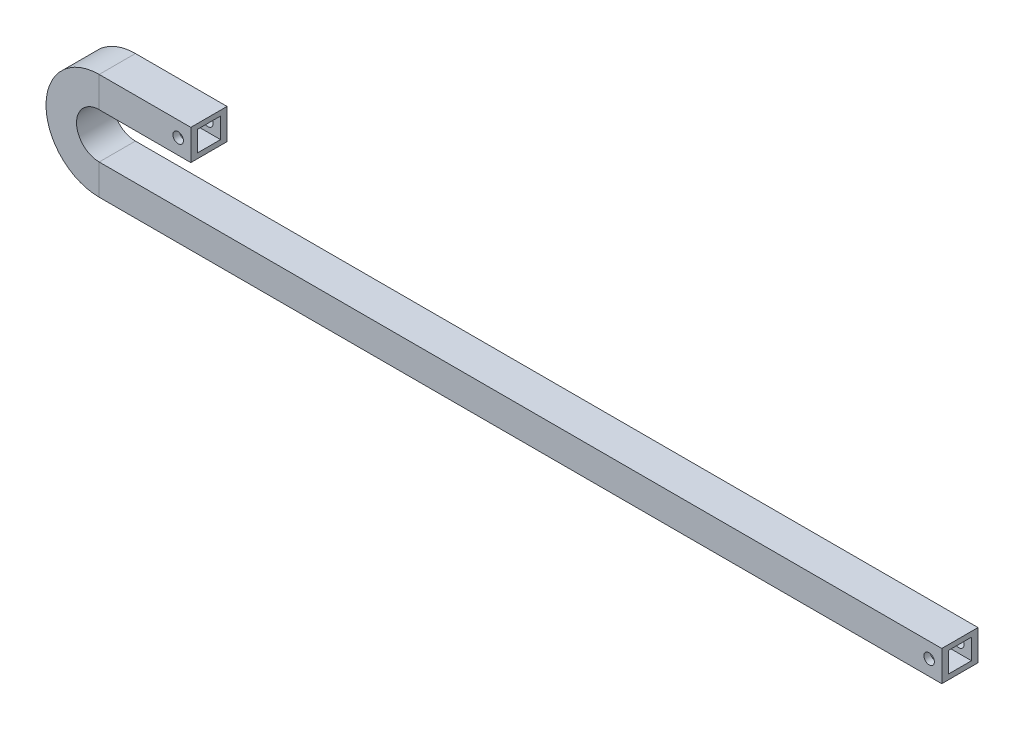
ISO-10303-21;
HEADER;
FILE_DESCRIPTION(('STEP AP214'),'2;1');
FILE_NAME('part.step','',(''),(''),'','','');
FILE_SCHEMA(('AUTOMOTIVE_DESIGN { 1 0 10303 214 1 1 1 1 }'));
ENDSEC;
DATA;
#1=APPLICATION_CONTEXT('core data for automotive mechanical design processes');
#2=APPLICATION_PROTOCOL_DEFINITION('international standard','automotive_design',2000,#1);
#3=PRODUCT_CONTEXT('',#1,'mechanical');
#4=PRODUCT('Part','Part','',(#3));
#5=PRODUCT_RELATED_PRODUCT_CATEGORY('part','',(#4));
#6=PRODUCT_DEFINITION_FORMATION('','',#4);
#7=PRODUCT_DEFINITION_CONTEXT('part definition',#1,'design');
#8=PRODUCT_DEFINITION('design','',#6,#7);
#9=PRODUCT_DEFINITION_SHAPE('','',#8);
#10=(LENGTH_UNIT() NAMED_UNIT(*) SI_UNIT(.MILLI.,.METRE.));
#11=(NAMED_UNIT(*) PLANE_ANGLE_UNIT() SI_UNIT($,.RADIAN.));
#12=(NAMED_UNIT(*) SI_UNIT($,.STERADIAN.) SOLID_ANGLE_UNIT());
#13=UNCERTAINTY_MEASURE_WITH_UNIT(LENGTH_MEASURE(1.E-05),#10,'distance_accuracy_value','');
#14=(GEOMETRIC_REPRESENTATION_CONTEXT(3) GLOBAL_UNCERTAINTY_ASSIGNED_CONTEXT((#13)) GLOBAL_UNIT_ASSIGNED_CONTEXT((#10,
#11,#12)) REPRESENTATION_CONTEXT('',''));
#15=CARTESIAN_POINT('',(0.,0.,0.));
#16=DIRECTION('',(0.,0.,1.));
#17=DIRECTION('',(1.,0.,0.));
#18=AXIS2_PLACEMENT_3D('',#15,#16,#17);
#19=CARTESIAN_POINT('',(-400.,31.15,5.5));
#20=DIRECTION('',(0.,1.,0.));
#21=DIRECTION('',(-1.,0.,0.));
#22=AXIS2_PLACEMENT_3D('',#19,#20,#21);
#23=PLANE('',#22);
#24=DIRECTION('',(0.,0.,1.));
#25=VECTOR('',#24,1.);
#26=CARTESIAN_POINT('',(-400.,31.15,5.5));
#27=LINE('',#26,#25);
#28=CARTESIAN_POINT('',(-400.,31.15,-5.5));
#29=VERTEX_POINT('',#28);
#30=CARTESIAN_POINT('',(-400.,31.15,5.5));
#31=VERTEX_POINT('',#30);
#32=EDGE_CURVE('E326',#29,#31,#27,.T.);
#33=ORIENTED_EDGE('',*,*,#32,.T.);
#34=DIRECTION('',(1.,0.,0.));
#35=VECTOR('',#34,1.);
#36=CARTESIAN_POINT('',(-400.,31.15,5.5));
#37=LINE('',#36,#35);
#38=CARTESIAN_POINT('',(-356.5,31.1499999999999,5.5));
#39=VERTEX_POINT('',#38);
#40=EDGE_CURVE('E55',#31,#39,#37,.T.);
#41=ORIENTED_EDGE('',*,*,#40,.T.);
#42=DIRECTION('',(0.,0.,1.));
#43=VECTOR('',#42,1.);
#44=CARTESIAN_POINT('',(-356.5,31.1499999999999,5.5));
#45=LINE('',#44,#43);
#46=CARTESIAN_POINT('',(-356.5,31.1499999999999,-5.5));
#47=VERTEX_POINT('',#46);
#48=EDGE_CURVE('E65',#47,#39,#45,.T.);
#49=ORIENTED_EDGE('',*,*,#48,.F.);
#50=DIRECTION('',(1.,0.,0.));
#51=VECTOR('',#50,1.);
#52=CARTESIAN_POINT('',(-400.,31.15,-5.5));
#53=LINE('',#52,#51);
#54=EDGE_CURVE('E11',#29,#47,#53,.T.);
#55=ORIENTED_EDGE('',*,*,#54,.F.);
#56=EDGE_LOOP('',(#33,#41,#49,#55));
#57=FACE_BOUND('',#56,.T.);
#58=ADVANCED_FACE('F47',(#57),#23,.T.);
#59=CARTESIAN_POINT('',(-400.,40.85,5.5));
#60=DIRECTION('',(0.,0.,-1.));
#61=DIRECTION('',(-1.,0.,0.));
#62=AXIS2_PLACEMENT_3D('',#59,#60,#61);
#63=PLANE('',#62);
#64=CARTESIAN_POINT('',(-362.5,36.,5.5));
#65=DIRECTION('',(0.,0.,-1.));
#66=DIRECTION('',(-1.,0.,0.));
#67=AXIS2_PLACEMENT_3D('',#64,#65,#66);
#68=CIRCLE('',#67,2.49999999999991);
#69=CARTESIAN_POINT('',(-360.,36.,5.5));
#70=VERTEX_POINT('',#69);
#71=EDGE_CURVE('E232',#70,#70,#68,.T.);
#72=ORIENTED_EDGE('',*,*,#71,.F.);
#73=EDGE_LOOP('',(#72));
#74=FACE_BOUND('',#73,.T.);
#75=DIRECTION('',(0.,1.,0.));
#76=VECTOR('',#75,1.);
#77=CARTESIAN_POINT('',(-400.,40.85,5.5));
#78=LINE('',#77,#76);
#79=CARTESIAN_POINT('',(-400.,40.85,5.5));
#80=VERTEX_POINT('',#79);
#81=EDGE_CURVE('E322',#31,#80,#78,.T.);
#82=ORIENTED_EDGE('',*,*,#81,.T.);
#83=DIRECTION('',(1.,0.,0.));
#84=VECTOR('',#83,1.);
#85=CARTESIAN_POINT('',(-400.,40.85,5.5));
#86=LINE('',#85,#84);
#87=CARTESIAN_POINT('',(-356.5,40.85,5.5));
#88=VERTEX_POINT('',#87);
#89=EDGE_CURVE('E397',#80,#88,#86,.T.);
#90=ORIENTED_EDGE('',*,*,#89,.T.);
#91=DIRECTION('',(0.,1.,0.));
#92=VECTOR('',#91,1.);
#93=CARTESIAN_POINT('',(-356.5,40.85,5.5));
#94=LINE('',#93,#92);
#95=EDGE_CURVE('E74',#39,#88,#94,.T.);
#96=ORIENTED_EDGE('',*,*,#95,.F.);
#97=ORIENTED_EDGE('',*,*,#40,.F.);
#98=EDGE_LOOP('',(#82,#90,#96,#97));
#99=FACE_BOUND('',#98,.T.);
#100=ADVANCED_FACE('F404',(#74,#99),#63,.T.);
#101=CARTESIAN_POINT('',(-400.,40.85,5.5));
#102=DIRECTION('',(0.,-1.,0.));
#103=DIRECTION('',(1.,0.,0.));
#104=AXIS2_PLACEMENT_3D('',#101,#102,#103);
#105=PLANE('',#104);
#106=DIRECTION('',(0.,0.,-1.));
#107=VECTOR('',#106,1.);
#108=CARTESIAN_POINT('',(-400.,40.85,5.5));
#109=LINE('',#108,#107);
#110=CARTESIAN_POINT('',(-400.,40.85,-5.5));
#111=VERTEX_POINT('',#110);
#112=EDGE_CURVE('E317',#80,#111,#109,.T.);
#113=ORIENTED_EDGE('',*,*,#112,.T.);
#114=DIRECTION('',(1.,0.,0.));
#115=VECTOR('',#114,1.);
#116=CARTESIAN_POINT('',(-400.,40.85,-5.5));
#117=LINE('',#116,#115);
#118=CARTESIAN_POINT('',(-356.5,40.85,-5.5));
#119=VERTEX_POINT('',#118);
#120=EDGE_CURVE('E379',#111,#119,#117,.T.);
#121=ORIENTED_EDGE('',*,*,#120,.T.);
#122=DIRECTION('',(0.,0.,-1.));
#123=VECTOR('',#122,1.);
#124=CARTESIAN_POINT('',(-356.5,40.85,5.5));
#125=LINE('',#124,#123);
#126=EDGE_CURVE('E370',#88,#119,#125,.T.);
#127=ORIENTED_EDGE('',*,*,#126,.F.);
#128=ORIENTED_EDGE('',*,*,#89,.F.);
#129=EDGE_LOOP('',(#113,#121,#127,#128));
#130=FACE_BOUND('',#129,.T.);
#131=ADVANCED_FACE('F450',(#130),#105,.T.);
#132=CARTESIAN_POINT('',(-400.,40.85,-5.5));
#133=DIRECTION('',(0.,0.,1.));
#134=DIRECTION('',(1.,0.,0.));
#135=AXIS2_PLACEMENT_3D('',#132,#133,#134);
#136=PLANE('',#135);
#137=CARTESIAN_POINT('',(-362.5,36.,-5.5));
#138=DIRECTION('',(0.,0.,1.));
#139=DIRECTION('',(1.,0.,0.));
#140=AXIS2_PLACEMENT_3D('',#137,#138,#139);
#141=CIRCLE('',#140,2.49999999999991);
#142=CARTESIAN_POINT('',(-360.,36.,-5.5));
#143=VERTEX_POINT('',#142);
#144=EDGE_CURVE('E828',#143,#143,#141,.T.);
#145=ORIENTED_EDGE('',*,*,#144,.F.);
#146=EDGE_LOOP('',(#145));
#147=FACE_BOUND('',#146,.T.);
#148=DIRECTION('',(0.,-1.,0.));
#149=VECTOR('',#148,1.);
#150=CARTESIAN_POINT('',(-400.,40.85,-5.5));
#151=LINE('',#150,#149);
#152=EDGE_CURVE('E313',#111,#29,#151,.T.);
#153=ORIENTED_EDGE('',*,*,#152,.T.);
#154=ORIENTED_EDGE('',*,*,#54,.T.);
#155=DIRECTION('',(0.,-1.,0.));
#156=VECTOR('',#155,1.);
#157=CARTESIAN_POINT('',(-356.5,40.85,-5.5));
#158=LINE('',#157,#156);
#159=EDGE_CURVE('E367',#119,#47,#158,.T.);
#160=ORIENTED_EDGE('',*,*,#159,.F.);
#161=ORIENTED_EDGE('',*,*,#120,.F.);
#162=EDGE_LOOP('',(#153,#154,#160,#161));
#163=FACE_BOUND('',#162,.T.);
#164=ADVANCED_FACE('F455',(#147,#163),#136,.T.);
#165=CARTESIAN_POINT('',(-400.,43.25,8.6));
#166=DIRECTION('',(0.,-1.,0.));
#167=DIRECTION('',(1.,0.,0.));
#168=AXIS2_PLACEMENT_3D('',#165,#166,#167);
#169=PLANE('',#168);
#170=DIRECTION('',(0.,0.,-1.));
#171=VECTOR('',#170,1.);
#172=CARTESIAN_POINT('',(-400.,43.25,8.6));
#173=LINE('',#172,#171);
#174=CARTESIAN_POINT('',(-400.,43.25,8.6));
#175=VERTEX_POINT('',#174);
#176=CARTESIAN_POINT('',(-400.,43.25,-8.6));
#177=VERTEX_POINT('',#176);
#178=EDGE_CURVE('E197',#175,#177,#173,.T.);
#179=ORIENTED_EDGE('',*,*,#178,.F.);
#180=DIRECTION('',(1.,0.,0.));
#181=VECTOR('',#180,1.);
#182=CARTESIAN_POINT('',(-400.,43.25,8.6));
#183=LINE('',#182,#181);
#184=CARTESIAN_POINT('',(-356.5,43.25,8.6));
#185=VERTEX_POINT('',#184);
#186=EDGE_CURVE('E387',#175,#185,#183,.T.);
#187=ORIENTED_EDGE('',*,*,#186,.T.);
#188=DIRECTION('',(0.,0.,-1.));
#189=VECTOR('',#188,1.);
#190=CARTESIAN_POINT('',(-356.5,43.25,8.6));
#191=LINE('',#190,#189);
#192=CARTESIAN_POINT('',(-356.5,43.25,-8.6));
#193=VERTEX_POINT('',#192);
#194=EDGE_CURVE('E363',#185,#193,#191,.T.);
#195=ORIENTED_EDGE('',*,*,#194,.T.);
#196=DIRECTION('',(1.,0.,0.));
#197=VECTOR('',#196,1.);
#198=CARTESIAN_POINT('',(-400.,43.25,-8.6));
#199=LINE('',#198,#197);
#200=EDGE_CURVE('E371',#177,#193,#199,.T.);
#201=ORIENTED_EDGE('',*,*,#200,.F.);
#202=EDGE_LOOP('',(#179,#187,#195,#201));
#203=FACE_BOUND('',#202,.T.);
#204=ADVANCED_FACE('F461',(#203),#169,.F.);
#205=CARTESIAN_POINT('',(-400.,43.25,8.6));
#206=DIRECTION('',(0.,0.,-1.));
#207=DIRECTION('',(-1.,0.,0.));
#208=AXIS2_PLACEMENT_3D('',#205,#206,#207);
#209=PLANE('',#208);
#210=CARTESIAN_POINT('',(-362.5,36.,8.6));
#211=DIRECTION('',(0.,0.,1.));
#212=DIRECTION('',(1.,0.,0.));
#213=AXIS2_PLACEMENT_3D('',#210,#211,#212);
#214=CIRCLE('',#213,2.49999999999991);
#215=CARTESIAN_POINT('',(-360.,36.,8.59999999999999));
#216=VERTEX_POINT('',#215);
#217=EDGE_CURVE('E812',#216,#216,#214,.T.);
#218=ORIENTED_EDGE('',*,*,#217,.F.);
#219=EDGE_LOOP('',(#218));
#220=FACE_BOUND('',#219,.T.);
#221=DIRECTION('',(0.,1.,0.));
#222=VECTOR('',#221,1.);
#223=CARTESIAN_POINT('',(-400.,43.25,8.6));
#224=LINE('',#223,#222);
#225=CARTESIAN_POINT('',(-400.,28.75,8.6));
#226=VERTEX_POINT('',#225);
#227=EDGE_CURVE('E306',#226,#175,#224,.T.);
#228=ORIENTED_EDGE('',*,*,#227,.F.);
#229=DIRECTION('',(1.,0.,0.));
#230=VECTOR('',#229,1.);
#231=CARTESIAN_POINT('',(-400.,28.75,8.6));
#232=LINE('',#231,#230);
#233=CARTESIAN_POINT('',(-356.5,28.75,8.6));
#234=VERTEX_POINT('',#233);
#235=EDGE_CURVE('E383',#226,#234,#232,.T.);
#236=ORIENTED_EDGE('',*,*,#235,.T.);
#237=DIRECTION('',(0.,1.,0.));
#238=VECTOR('',#237,1.);
#239=CARTESIAN_POINT('',(-356.5,43.25,8.6));
#240=LINE('',#239,#238);
#241=EDGE_CURVE('E360',#234,#185,#240,.T.);
#242=ORIENTED_EDGE('',*,*,#241,.T.);
#243=ORIENTED_EDGE('',*,*,#186,.F.);
#244=EDGE_LOOP('',(#228,#236,#242,#243));
#245=FACE_BOUND('',#244,.T.);
#246=ADVANCED_FACE('F465',(#220,#245),#209,.F.);
#247=CARTESIAN_POINT('',(-400.,28.75,8.6));
#248=DIRECTION('',(0.,1.,0.));
#249=DIRECTION('',(-1.,0.,0.));
#250=AXIS2_PLACEMENT_3D('',#247,#248,#249);
#251=PLANE('',#250);
#252=DIRECTION('',(0.,0.,1.));
#253=VECTOR('',#252,1.);
#254=CARTESIAN_POINT('',(-400.,28.75,8.6));
#255=LINE('',#254,#253);
#256=CARTESIAN_POINT('',(-400.,28.75,-8.6));
#257=VERTEX_POINT('',#256);
#258=EDGE_CURVE('E303',#257,#226,#255,.T.);
#259=ORIENTED_EDGE('',*,*,#258,.F.);
#260=DIRECTION('',(1.,0.,0.));
#261=VECTOR('',#260,1.);
#262=CARTESIAN_POINT('',(-400.,28.75,-8.6));
#263=LINE('',#262,#261);
#264=CARTESIAN_POINT('',(-356.5,28.75,-8.6));
#265=VERTEX_POINT('',#264);
#266=EDGE_CURVE('E366',#257,#265,#263,.T.);
#267=ORIENTED_EDGE('',*,*,#266,.T.);
#268=DIRECTION('',(0.,0.,1.));
#269=VECTOR('',#268,1.);
#270=CARTESIAN_POINT('',(-356.5,28.75,8.6));
#271=LINE('',#270,#269);
#272=EDGE_CURVE('E357',#265,#234,#271,.T.);
#273=ORIENTED_EDGE('',*,*,#272,.T.);
#274=ORIENTED_EDGE('',*,*,#235,.F.);
#275=EDGE_LOOP('',(#259,#267,#273,#274));
#276=FACE_BOUND('',#275,.T.);
#277=ADVANCED_FACE('F443',(#276),#251,.F.);
#278=CARTESIAN_POINT('',(-400.,43.25,-8.6));
#279=DIRECTION('',(0.,0.,1.));
#280=DIRECTION('',(1.,0.,0.));
#281=AXIS2_PLACEMENT_3D('',#278,#279,#280);
#282=PLANE('',#281);
#283=CARTESIAN_POINT('',(-362.5,36.,-8.6));
#284=DIRECTION('',(0.,0.,1.));
#285=DIRECTION('',(1.,0.,0.));
#286=AXIS2_PLACEMENT_3D('',#283,#284,#285);
#287=CIRCLE('',#286,2.49999999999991);
#288=CARTESIAN_POINT('',(-360.,36.,-8.6));
#289=VERTEX_POINT('',#288);
#290=EDGE_CURVE('E820',#289,#289,#287,.T.);
#291=ORIENTED_EDGE('',*,*,#290,.T.);
#292=EDGE_LOOP('',(#291));
#293=FACE_BOUND('',#292,.T.);
#294=DIRECTION('',(0.,-1.,0.));
#295=VECTOR('',#294,1.);
#296=CARTESIAN_POINT('',(-400.,43.25,-8.6));
#297=LINE('',#296,#295);
#298=EDGE_CURVE('E192',#177,#257,#297,.T.);
#299=ORIENTED_EDGE('',*,*,#298,.F.);
#300=ORIENTED_EDGE('',*,*,#200,.T.);
#301=DIRECTION('',(0.,-1.,0.));
#302=VECTOR('',#301,1.);
#303=CARTESIAN_POINT('',(-356.5,43.25,-8.6));
#304=LINE('',#303,#302);
#305=EDGE_CURVE('E354',#193,#265,#304,.T.);
#306=ORIENTED_EDGE('',*,*,#305,.T.);
#307=ORIENTED_EDGE('',*,*,#266,.F.);
#308=EDGE_LOOP('',(#299,#300,#306,#307));
#309=FACE_BOUND('',#308,.T.);
#310=ADVANCED_FACE('F436',(#293,#309),#282,.F.);
#311=CARTESIAN_POINT('',(-400.,18.,0.));
#312=DIRECTION('',(0.,0.,-1.));
#313=DIRECTION('',(-1.,0.,0.));
#314=AXIS2_PLACEMENT_3D('',#311,#312,#313);
#315=CYLINDRICAL_SURFACE('',#314,13.15);
#316=DIRECTION('',(0.,0.,1.));
#317=VECTOR('',#316,1.);
#318=CARTESIAN_POINT('',(-400.,4.84999999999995,5.5));
#319=LINE('',#318,#317);
#320=CARTESIAN_POINT('',(-400.,4.84999999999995,-5.5));
#321=VERTEX_POINT('',#320);
#322=CARTESIAN_POINT('',(-400.,4.84999999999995,5.5));
#323=VERTEX_POINT('',#322);
#324=EDGE_CURVE('E219',#321,#323,#319,.T.);
#325=ORIENTED_EDGE('',*,*,#324,.T.);
#326=CARTESIAN_POINT('',(-400.,18.,5.5));
#327=DIRECTION('',(0.,0.,-1.));
#328=DIRECTION('',(-1.,0.,0.));
#329=AXIS2_PLACEMENT_3D('',#326,#327,#328);
#330=CIRCLE('',#329,13.15);
#331=EDGE_CURVE('E346',#323,#31,#330,.T.);
#332=ORIENTED_EDGE('',*,*,#331,.T.);
#333=ORIENTED_EDGE('',*,*,#32,.F.);
#334=CARTESIAN_POINT('',(-400.,18.,-5.5));
#335=DIRECTION('',(0.,0.,-1.));
#336=DIRECTION('',(-1.,0.,0.));
#337=AXIS2_PLACEMENT_3D('',#334,#335,#336);
#338=CIRCLE('',#337,13.15);
#339=EDGE_CURVE('E350',#321,#29,#338,.T.);
#340=ORIENTED_EDGE('',*,*,#339,.F.);
#341=EDGE_LOOP('',(#325,#332,#333,#340));
#342=FACE_BOUND('',#341,.T.);
#343=ADVANCED_FACE('F434',(#342),#315,.T.);
#344=CARTESIAN_POINT('',(-400.,-4.85000000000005,5.5));
#345=DIRECTION('',(0.,0.,-1.));
#346=DIRECTION('',(-1.,0.,0.));
#347=AXIS2_PLACEMENT_3D('',#344,#345,#346);
#348=PLANE('',#347);
#349=DIRECTION('',(0.,-1.,0.));
#350=VECTOR('',#349,1.);
#351=CARTESIAN_POINT('',(-400.,-4.85000000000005,5.5));
#352=LINE('',#351,#350);
#353=CARTESIAN_POINT('',(-400.,-4.85000000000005,5.5));
#354=VERTEX_POINT('',#353);
#355=EDGE_CURVE('E249',#323,#354,#352,.T.);
#356=ORIENTED_EDGE('',*,*,#355,.T.);
#357=CARTESIAN_POINT('',(-400.,18.,5.5));
#358=DIRECTION('',(0.,0.,-1.));
#359=DIRECTION('',(-1.,0.,0.));
#360=AXIS2_PLACEMENT_3D('',#357,#358,#359);
#361=CIRCLE('',#360,22.85);
#362=EDGE_CURVE('E342',#354,#80,#361,.T.);
#363=ORIENTED_EDGE('',*,*,#362,.T.);
#364=ORIENTED_EDGE('',*,*,#81,.F.);
#365=ORIENTED_EDGE('',*,*,#331,.F.);
#366=EDGE_LOOP('',(#356,#363,#364,#365));
#367=FACE_BOUND('',#366,.T.);
#368=ADVANCED_FACE('F411',(#367),#348,.T.);
#369=CARTESIAN_POINT('',(-400.,18.,0.));
#370=DIRECTION('',(0.,0.,-1.));
#371=DIRECTION('',(-1.,0.,0.));
#372=AXIS2_PLACEMENT_3D('',#369,#370,#371);
#373=CYLINDRICAL_SURFACE('',#372,22.85);
#374=DIRECTION('',(0.,0.,-1.));
#375=VECTOR('',#374,1.);
#376=CARTESIAN_POINT('',(-400.,-4.85000000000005,5.5));
#377=LINE('',#376,#375);
#378=CARTESIAN_POINT('',(-400.,-4.85000000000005,-5.5));
#379=VERTEX_POINT('',#378);
#380=EDGE_CURVE('E245',#354,#379,#377,.T.);
#381=ORIENTED_EDGE('',*,*,#380,.T.);
#382=CARTESIAN_POINT('',(-400.,18.,-5.5));
#383=DIRECTION('',(0.,0.,-1.));
#384=DIRECTION('',(-1.,0.,0.));
#385=AXIS2_PLACEMENT_3D('',#382,#383,#384);
#386=CIRCLE('',#385,22.85);
#387=EDGE_CURVE('E329',#379,#111,#386,.T.);
#388=ORIENTED_EDGE('',*,*,#387,.T.);
#389=ORIENTED_EDGE('',*,*,#112,.F.);
#390=ORIENTED_EDGE('',*,*,#362,.F.);
#391=EDGE_LOOP('',(#381,#388,#389,#390));
#392=FACE_BOUND('',#391,.T.);
#393=ADVANCED_FACE('F408',(#392),#373,.F.);
#394=CARTESIAN_POINT('',(-400.,-4.85000000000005,-5.5));
#395=DIRECTION('',(0.,0.,1.));
#396=DIRECTION('',(1.,0.,0.));
#397=AXIS2_PLACEMENT_3D('',#394,#395,#396);
#398=PLANE('',#397);
#399=DIRECTION('',(0.,1.,0.));
#400=VECTOR('',#399,1.);
#401=CARTESIAN_POINT('',(-400.,-4.85000000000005,-5.5));
#402=LINE('',#401,#400);
#403=EDGE_CURVE('E241',#379,#321,#402,.T.);
#404=ORIENTED_EDGE('',*,*,#403,.T.);
#405=ORIENTED_EDGE('',*,*,#339,.T.);
#406=ORIENTED_EDGE('',*,*,#152,.F.);
#407=ORIENTED_EDGE('',*,*,#387,.F.);
#408=EDGE_LOOP('',(#404,#405,#406,#407));
#409=FACE_BOUND('',#408,.T.);
#410=ADVANCED_FACE('F429',(#409),#398,.T.);
#411=CARTESIAN_POINT('',(-400.,18.,0.));
#412=DIRECTION('',(0.,0.,-1.));
#413=DIRECTION('',(-1.,0.,0.));
#414=AXIS2_PLACEMENT_3D('',#411,#412,#413);
#415=CYLINDRICAL_SURFACE('',#414,25.25);
#416=DIRECTION('',(0.,0.,-1.));
#417=VECTOR('',#416,1.);
#418=CARTESIAN_POINT('',(-400.,-7.25000000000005,8.6));
#419=LINE('',#418,#417);
#420=CARTESIAN_POINT('',(-400.,-7.25000000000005,8.6));
#421=VERTEX_POINT('',#420);
#422=CARTESIAN_POINT('',(-400.,-7.25000000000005,-8.6));
#423=VERTEX_POINT('',#422);
#424=EDGE_CURVE('E238',#421,#423,#419,.T.);
#425=ORIENTED_EDGE('',*,*,#424,.F.);
#426=CARTESIAN_POINT('',(-400.,18.,8.6));
#427=DIRECTION('',(0.,0.,-1.));
#428=DIRECTION('',(-1.,0.,0.));
#429=AXIS2_PLACEMENT_3D('',#426,#427,#428);
#430=CIRCLE('',#429,25.25);
#431=EDGE_CURVE('E333',#421,#175,#430,.T.);
#432=ORIENTED_EDGE('',*,*,#431,.T.);
#433=ORIENTED_EDGE('',*,*,#178,.T.);
#434=CARTESIAN_POINT('',(-400.,18.,-8.6));
#435=DIRECTION('',(0.,0.,-1.));
#436=DIRECTION('',(-1.,0.,0.));
#437=AXIS2_PLACEMENT_3D('',#434,#435,#436);
#438=CIRCLE('',#437,25.25);
#439=EDGE_CURVE('E318',#423,#177,#438,.T.);
#440=ORIENTED_EDGE('',*,*,#439,.F.);
#441=EDGE_LOOP('',(#425,#432,#433,#440));
#442=FACE_BOUND('',#441,.T.);
#443=ADVANCED_FACE('F491',(#442),#415,.T.);
#444=CARTESIAN_POINT('',(-400.,-7.25000000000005,8.6));
#445=DIRECTION('',(0.,0.,-1.));
#446=DIRECTION('',(-1.,0.,0.));
#447=AXIS2_PLACEMENT_3D('',#444,#445,#446);
#448=PLANE('',#447);
#449=DIRECTION('',(0.,-1.,0.));
#450=VECTOR('',#449,1.);
#451=CARTESIAN_POINT('',(-400.,-7.25000000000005,8.6));
#452=LINE('',#451,#450);
#453=CARTESIAN_POINT('',(-400.,7.24999999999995,8.6));
#454=VERTEX_POINT('',#453);
#455=EDGE_CURVE('E207',#454,#421,#452,.T.);
#456=ORIENTED_EDGE('',*,*,#455,.F.);
#457=CARTESIAN_POINT('',(-400.,18.,8.6));
#458=DIRECTION('',(0.,0.,-1.));
#459=DIRECTION('',(-1.,0.,0.));
#460=AXIS2_PLACEMENT_3D('',#457,#458,#459);
#461=CIRCLE('',#460,10.75);
#462=EDGE_CURVE('E196',#454,#226,#461,.T.);
#463=ORIENTED_EDGE('',*,*,#462,.T.);
#464=ORIENTED_EDGE('',*,*,#227,.T.);
#465=ORIENTED_EDGE('',*,*,#431,.F.);
#466=EDGE_LOOP('',(#456,#463,#464,#465));
#467=FACE_BOUND('',#466,.T.);
#468=ADVANCED_FACE('F477',(#467),#448,.F.);
#469=CARTESIAN_POINT('',(-400.,18.,0.));
#470=DIRECTION('',(0.,0.,-1.));
#471=DIRECTION('',(-1.,0.,0.));
#472=AXIS2_PLACEMENT_3D('',#469,#470,#471);
#473=CYLINDRICAL_SURFACE('',#472,10.75);
#474=DIRECTION('',(0.,0.,1.));
#475=VECTOR('',#474,1.);
#476=CARTESIAN_POINT('',(-400.,7.24999999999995,8.6));
#477=LINE('',#476,#475);
#478=CARTESIAN_POINT('',(-400.,7.24999999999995,-8.6));
#479=VERTEX_POINT('',#478);
#480=EDGE_CURVE('E200',#479,#454,#477,.T.);
#481=ORIENTED_EDGE('',*,*,#480,.F.);
#482=CARTESIAN_POINT('',(-400.,18.,-8.6));
#483=DIRECTION('',(0.,0.,-1.));
#484=DIRECTION('',(-1.,0.,0.));
#485=AXIS2_PLACEMENT_3D('',#482,#483,#484);
#486=CIRCLE('',#485,10.75);
#487=EDGE_CURVE('E184',#479,#257,#486,.T.);
#488=ORIENTED_EDGE('',*,*,#487,.T.);
#489=ORIENTED_EDGE('',*,*,#258,.T.);
#490=ORIENTED_EDGE('',*,*,#462,.F.);
#491=EDGE_LOOP('',(#481,#488,#489,#490));
#492=FACE_BOUND('',#491,.T.);
#493=ADVANCED_FACE('F202',(#492),#473,.F.);
#494=CARTESIAN_POINT('',(-400.,-7.25000000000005,-8.6));
#495=DIRECTION('',(0.,0.,1.));
#496=DIRECTION('',(1.,0.,0.));
#497=AXIS2_PLACEMENT_3D('',#494,#495,#496);
#498=PLANE('',#497);
#499=DIRECTION('',(0.,1.,0.));
#500=VECTOR('',#499,1.);
#501=CARTESIAN_POINT('',(-400.,-7.25000000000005,-8.6));
#502=LINE('',#501,#500);
#503=EDGE_CURVE('E189',#423,#479,#502,.T.);
#504=ORIENTED_EDGE('',*,*,#503,.F.);
#505=ORIENTED_EDGE('',*,*,#439,.T.);
#506=ORIENTED_EDGE('',*,*,#298,.T.);
#507=ORIENTED_EDGE('',*,*,#487,.F.);
#508=EDGE_LOOP('',(#504,#505,#506,#507));
#509=FACE_BOUND('',#508,.T.);
#510=ADVANCED_FACE('F186',(#509),#498,.F.);
#511=CARTESIAN_POINT('',(-400.,-4.85000000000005,-5.5));
#512=DIRECTION('',(0.,0.,-1.));
#513=DIRECTION('',(-1.,0.,0.));
#514=AXIS2_PLACEMENT_3D('',#511,#512,#513);
#515=PLANE('',#514);
#516=CARTESIAN_POINT('',(-6.00000000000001,0.,-5.5));
#517=DIRECTION('',(0.,0.,-1.));
#518=DIRECTION('',(-1.,0.,0.));
#519=AXIS2_PLACEMENT_3D('',#516,#517,#518);
#520=CIRCLE('',#519,2.5);
#521=CARTESIAN_POINT('',(-3.50000000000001,0.,-5.5));
#522=VERTEX_POINT('',#521);
#523=EDGE_CURVE('E810',#522,#522,#520,.T.);
#524=ORIENTED_EDGE('',*,*,#523,.T.);
#525=EDGE_LOOP('',(#524));
#526=FACE_BOUND('',#525,.T.);
#527=DIRECTION('',(0.,1.,0.));
#528=VECTOR('',#527,1.);
#529=CARTESIAN_POINT('',(0.,-4.85,-5.5));
#530=LINE('',#529,#528);
#531=CARTESIAN_POINT('',(0.,-4.85,-5.5));
#532=VERTEX_POINT('',#531);
#533=CARTESIAN_POINT('',(0.,4.85,-5.5));
#534=VERTEX_POINT('',#533);
#535=EDGE_CURVE('E269',#532,#534,#530,.T.);
#536=ORIENTED_EDGE('',*,*,#535,.T.);
#537=DIRECTION('',(1.,0.,0.));
#538=VECTOR('',#537,1.);
#539=CARTESIAN_POINT('',(-400.,4.84999999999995,-5.5));
#540=LINE('',#539,#538);
#541=EDGE_CURVE('E278',#321,#534,#540,.T.);
#542=ORIENTED_EDGE('',*,*,#541,.F.);
#543=ORIENTED_EDGE('',*,*,#403,.F.);
#544=DIRECTION('',(1.,0.,0.));
#545=VECTOR('',#544,1.);
#546=CARTESIAN_POINT('',(-400.,-4.85000000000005,-5.5));
#547=LINE('',#546,#545);
#548=EDGE_CURVE('E290',#379,#532,#547,.T.);
#549=ORIENTED_EDGE('',*,*,#548,.T.);
#550=EDGE_LOOP('',(#536,#542,#543,#549));
#551=FACE_BOUND('',#550,.T.);
#552=ADVANCED_FACE('F426',(#526,#551),#515,.F.);
#553=CARTESIAN_POINT('',(-400.,4.84999999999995,5.5));
#554=DIRECTION('',(0.,1.,0.));
#555=DIRECTION('',(-1.,0.,0.));
#556=AXIS2_PLACEMENT_3D('',#553,#554,#555);
#557=PLANE('',#556);
#558=DIRECTION('',(0.,0.,1.));
#559=VECTOR('',#558,1.);
#560=CARTESIAN_POINT('',(0.,4.85,5.5));
#561=LINE('',#560,#559);
#562=CARTESIAN_POINT('',(0.,4.85,5.5));
#563=VERTEX_POINT('',#562);
#564=EDGE_CURVE('E225',#534,#563,#561,.T.);
#565=ORIENTED_EDGE('',*,*,#564,.T.);
#566=DIRECTION('',(1.,0.,0.));
#567=VECTOR('',#566,1.);
#568=CARTESIAN_POINT('',(-400.,4.84999999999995,5.5));
#569=LINE('',#568,#567);
#570=EDGE_CURVE('E282',#323,#563,#569,.T.);
#571=ORIENTED_EDGE('',*,*,#570,.F.);
#572=ORIENTED_EDGE('',*,*,#324,.F.);
#573=ORIENTED_EDGE('',*,*,#541,.T.);
#574=EDGE_LOOP('',(#565,#571,#572,#573));
#575=FACE_BOUND('',#574,.T.);
#576=ADVANCED_FACE('F432',(#575),#557,.F.);
#577=CARTESIAN_POINT('',(-400.,-4.85000000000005,5.5));
#578=DIRECTION('',(0.,0.,1.));
#579=DIRECTION('',(1.,0.,0.));
#580=AXIS2_PLACEMENT_3D('',#577,#578,#579);
#581=PLANE('',#580);
#582=CARTESIAN_POINT('',(-6.00000000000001,0.,5.5));
#583=DIRECTION('',(0.,0.,1.));
#584=DIRECTION('',(1.,0.,0.));
#585=AXIS2_PLACEMENT_3D('',#582,#583,#584);
#586=CIRCLE('',#585,2.5);
#587=CARTESIAN_POINT('',(-3.50000000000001,0.,5.5));
#588=VERTEX_POINT('',#587);
#589=EDGE_CURVE('E813',#588,#588,#586,.T.);
#590=ORIENTED_EDGE('',*,*,#589,.T.);
#591=EDGE_LOOP('',(#590));
#592=FACE_BOUND('',#591,.T.);
#593=DIRECTION('',(0.,-1.,0.));
#594=VECTOR('',#593,1.);
#595=CARTESIAN_POINT('',(0.,-4.85,5.5));
#596=LINE('',#595,#594);
#597=CARTESIAN_POINT('',(0.,-4.85,5.5));
#598=VERTEX_POINT('',#597);
#599=EDGE_CURVE('E229',#563,#598,#596,.T.);
#600=ORIENTED_EDGE('',*,*,#599,.T.);
#601=DIRECTION('',(1.,0.,0.));
#602=VECTOR('',#601,1.);
#603=CARTESIAN_POINT('',(-400.,-4.85000000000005,5.5));
#604=LINE('',#603,#602);
#605=EDGE_CURVE('E286',#354,#598,#604,.T.);
#606=ORIENTED_EDGE('',*,*,#605,.F.);
#607=ORIENTED_EDGE('',*,*,#355,.F.);
#608=ORIENTED_EDGE('',*,*,#570,.T.);
#609=EDGE_LOOP('',(#600,#606,#607,#608));
#610=FACE_BOUND('',#609,.T.);
#611=ADVANCED_FACE('F416',(#592,#610),#581,.F.);
#612=CARTESIAN_POINT('',(-400.,-7.25000000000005,-8.6));
#613=DIRECTION('',(0.,0.,-1.));
#614=DIRECTION('',(-1.,0.,0.));
#615=AXIS2_PLACEMENT_3D('',#612,#613,#614);
#616=PLANE('',#615);
#617=CARTESIAN_POINT('',(-6.00000000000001,0.,-8.6));
#618=DIRECTION('',(0.,0.,1.));
#619=DIRECTION('',(1.,0.,0.));
#620=AXIS2_PLACEMENT_3D('',#617,#618,#619);
#621=CIRCLE('',#620,2.5);
#622=CARTESIAN_POINT('',(-3.50000000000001,0.,-8.6));
#623=VERTEX_POINT('',#622);
#624=EDGE_CURVE('E807',#623,#623,#621,.T.);
#625=ORIENTED_EDGE('',*,*,#624,.T.);
#626=EDGE_LOOP('',(#625));
#627=FACE_BOUND('',#626,.T.);
#628=DIRECTION('',(0.,1.,0.));
#629=VECTOR('',#628,1.);
#630=CARTESIAN_POINT('',(0.,-7.25,-8.6));
#631=LINE('',#630,#629);
#632=CARTESIAN_POINT('',(0.,-7.25,-8.6));
#633=VERTEX_POINT('',#632);
#634=CARTESIAN_POINT('',(0.,7.25,-8.6));
#635=VERTEX_POINT('',#634);
#636=EDGE_CURVE('E256',#633,#635,#631,.T.);
#637=ORIENTED_EDGE('',*,*,#636,.F.);
#638=DIRECTION('',(1.,0.,0.));
#639=VECTOR('',#638,1.);
#640=CARTESIAN_POINT('',(-400.,-7.25000000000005,-8.6));
#641=LINE('',#640,#639);
#642=EDGE_CURVE('E222',#423,#633,#641,.T.);
#643=ORIENTED_EDGE('',*,*,#642,.F.);
#644=ORIENTED_EDGE('',*,*,#503,.T.);
#645=DIRECTION('',(1.,0.,0.));
#646=VECTOR('',#645,1.);
#647=CARTESIAN_POINT('',(-400.,7.24999999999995,-8.6));
#648=LINE('',#647,#646);
#649=EDGE_CURVE('E210',#479,#635,#648,.T.);
#650=ORIENTED_EDGE('',*,*,#649,.T.);
#651=EDGE_LOOP('',(#637,#643,#644,#650));
#652=FACE_BOUND('',#651,.T.);
#653=ADVANCED_FACE('F221',(#627,#652),#616,.T.);
#654=CARTESIAN_POINT('',(-400.,-7.25000000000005,8.6));
#655=DIRECTION('',(0.,-1.,0.));
#656=DIRECTION('',(1.,0.,0.));
#657=AXIS2_PLACEMENT_3D('',#654,#655,#656);
#658=PLANE('',#657);
#659=DIRECTION('',(0.,0.,-1.));
#660=VECTOR('',#659,1.);
#661=CARTESIAN_POINT('',(0.,-7.25,8.6));
#662=LINE('',#661,#660);
#663=CARTESIAN_POINT('',(0.,-7.25,8.6));
#664=VERTEX_POINT('',#663);
#665=EDGE_CURVE('E265',#664,#633,#662,.T.);
#666=ORIENTED_EDGE('',*,*,#665,.F.);
#667=DIRECTION('',(1.,0.,0.));
#668=VECTOR('',#667,1.);
#669=CARTESIAN_POINT('',(-400.,-7.25000000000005,8.6));
#670=LINE('',#669,#668);
#671=EDGE_CURVE('E296',#421,#664,#670,.T.);
#672=ORIENTED_EDGE('',*,*,#671,.F.);
#673=ORIENTED_EDGE('',*,*,#424,.T.);
#674=ORIENTED_EDGE('',*,*,#642,.T.);
#675=EDGE_LOOP('',(#666,#672,#673,#674));
#676=FACE_BOUND('',#675,.T.);
#677=ADVANCED_FACE('F489',(#676),#658,.T.);
#678=CARTESIAN_POINT('',(-400.,-7.25000000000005,8.6));
#679=DIRECTION('',(0.,0.,1.));
#680=DIRECTION('',(1.,0.,0.));
#681=AXIS2_PLACEMENT_3D('',#678,#679,#680);
#682=PLANE('',#681);
#683=CARTESIAN_POINT('',(-6.00000000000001,0.,8.6));
#684=DIRECTION('',(0.,0.,1.));
#685=DIRECTION('',(1.,0.,0.));
#686=AXIS2_PLACEMENT_3D('',#683,#684,#685);
#687=CIRCLE('',#686,2.5);
#688=CARTESIAN_POINT('',(-3.50000000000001,0.,8.59999999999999));
#689=VERTEX_POINT('',#688);
#690=EDGE_CURVE('E922',#689,#689,#687,.T.);
#691=ORIENTED_EDGE('',*,*,#690,.F.);
#692=EDGE_LOOP('',(#691));
#693=FACE_BOUND('',#692,.T.);
#694=DIRECTION('',(0.,-1.,0.));
#695=VECTOR('',#694,1.);
#696=CARTESIAN_POINT('',(0.,-7.25,8.6));
#697=LINE('',#696,#695);
#698=CARTESIAN_POINT('',(0.,7.25,8.6));
#699=VERTEX_POINT('',#698);
#700=EDGE_CURVE('E261',#699,#664,#697,.T.);
#701=ORIENTED_EDGE('',*,*,#700,.F.);
#702=DIRECTION('',(1.,0.,0.));
#703=VECTOR('',#702,1.);
#704=CARTESIAN_POINT('',(-400.,7.24999999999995,8.6));
#705=LINE('',#704,#703);
#706=EDGE_CURVE('E218',#454,#699,#705,.T.);
#707=ORIENTED_EDGE('',*,*,#706,.F.);
#708=ORIENTED_EDGE('',*,*,#455,.T.);
#709=ORIENTED_EDGE('',*,*,#671,.T.);
#710=EDGE_LOOP('',(#701,#707,#708,#709));
#711=FACE_BOUND('',#710,.T.);
#712=ADVANCED_FACE('F482',(#693,#711),#682,.T.);
#713=CARTESIAN_POINT('',(-400.,7.24999999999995,8.6));
#714=DIRECTION('',(0.,1.,0.));
#715=DIRECTION('',(-1.,0.,0.));
#716=AXIS2_PLACEMENT_3D('',#713,#714,#715);
#717=PLANE('',#716);
#718=DIRECTION('',(0.,0.,1.));
#719=VECTOR('',#718,1.);
#720=CARTESIAN_POINT('',(0.,7.25,8.6));
#721=LINE('',#720,#719);
#722=EDGE_CURVE('E213',#635,#699,#721,.T.);
#723=ORIENTED_EDGE('',*,*,#722,.F.);
#724=ORIENTED_EDGE('',*,*,#649,.F.);
#725=ORIENTED_EDGE('',*,*,#480,.T.);
#726=ORIENTED_EDGE('',*,*,#706,.T.);
#727=EDGE_LOOP('',(#723,#724,#725,#726));
#728=FACE_BOUND('',#727,.T.);
#729=ADVANCED_FACE('F211',(#728),#717,.T.);
#730=CARTESIAN_POINT('',(-400.,-4.85000000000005,5.5));
#731=DIRECTION('',(0.,-1.,0.));
#732=DIRECTION('',(1.,0.,0.));
#733=AXIS2_PLACEMENT_3D('',#730,#731,#732);
#734=PLANE('',#733);
#735=DIRECTION('',(0.,0.,-1.));
#736=VECTOR('',#735,1.);
#737=CARTESIAN_POINT('',(0.,-4.85,5.5));
#738=LINE('',#737,#736);
#739=EDGE_CURVE('E273',#598,#532,#738,.T.);
#740=ORIENTED_EDGE('',*,*,#739,.T.);
#741=ORIENTED_EDGE('',*,*,#548,.F.);
#742=ORIENTED_EDGE('',*,*,#380,.F.);
#743=ORIENTED_EDGE('',*,*,#605,.T.);
#744=EDGE_LOOP('',(#740,#741,#742,#743));
#745=FACE_BOUND('',#744,.T.);
#746=ADVANCED_FACE('F421',(#745),#734,.F.);
#747=CARTESIAN_POINT('',(-356.5,36.,0.));
#748=DIRECTION('',(1.,0.,0.));
#749=DIRECTION('',(0.,0.,1.));
#750=AXIS2_PLACEMENT_3D('',#747,#748,#749);
#751=PLANE('',#750);
#752=ORIENTED_EDGE('',*,*,#305,.F.);
#753=ORIENTED_EDGE('',*,*,#194,.F.);
#754=ORIENTED_EDGE('',*,*,#241,.F.);
#755=ORIENTED_EDGE('',*,*,#272,.F.);
#756=EDGE_LOOP('',(#752,#753,#754,#755));
#757=FACE_BOUND('',#756,.T.);
#758=ORIENTED_EDGE('',*,*,#159,.T.);
#759=ORIENTED_EDGE('',*,*,#48,.T.);
#760=ORIENTED_EDGE('',*,*,#95,.T.);
#761=ORIENTED_EDGE('',*,*,#126,.T.);
#762=EDGE_LOOP('',(#758,#759,#760,#761));
#763=FACE_BOUND('',#762,.T.);
#764=ADVANCED_FACE('F499',(#757,#763),#751,.T.);
#765=CARTESIAN_POINT('',(0.,0.,0.));
#766=DIRECTION('',(-1.,0.,0.));
#767=DIRECTION('',(0.,0.,1.));
#768=AXIS2_PLACEMENT_3D('',#765,#766,#767);
#769=PLANE('',#768);
#770=ORIENTED_EDGE('',*,*,#636,.T.);
#771=ORIENTED_EDGE('',*,*,#722,.T.);
#772=ORIENTED_EDGE('',*,*,#700,.T.);
#773=ORIENTED_EDGE('',*,*,#665,.T.);
#774=EDGE_LOOP('',(#770,#771,#772,#773));
#775=FACE_BOUND('',#774,.T.);
#776=ORIENTED_EDGE('',*,*,#535,.F.);
#777=ORIENTED_EDGE('',*,*,#739,.F.);
#778=ORIENTED_EDGE('',*,*,#599,.F.);
#779=ORIENTED_EDGE('',*,*,#564,.F.);
#780=EDGE_LOOP('',(#776,#777,#778,#779));
#781=FACE_BOUND('',#780,.T.);
#782=ADVANCED_FACE('F486',(#775,#781),#769,.F.);
#783=CARTESIAN_POINT('',(-362.5,36.,-8.6));
#784=DIRECTION('',(0.,0.,1.));
#785=DIRECTION('',(1.,0.,0.));
#786=AXIS2_PLACEMENT_3D('',#783,#784,#785);
#787=CYLINDRICAL_SURFACE('',#786,2.49999999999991);
#788=CARTESIAN_POINT('',(-360.,36.,-5.5));
#789=CARTESIAN_POINT('',(-360.,36.,-5.53229166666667));
#790=CARTESIAN_POINT('',(-360.,36.,-5.56458333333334));
#791=CARTESIAN_POINT('',(-360.,36.,-5.62916666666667));
#792=CARTESIAN_POINT('',(-360.,36.,-5.66145833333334));
#793=CARTESIAN_POINT('',(-360.,36.,-5.72604166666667));
#794=CARTESIAN_POINT('',(-360.,36.,-5.75833333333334));
#795=CARTESIAN_POINT('',(-360.,36.,-5.82291666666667));
#796=CARTESIAN_POINT('',(-360.,36.,-5.85520833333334));
#797=CARTESIAN_POINT('',(-360.,36.,-5.91979166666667));
#798=CARTESIAN_POINT('',(-360.,36.,-5.95208333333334));
#799=CARTESIAN_POINT('',(-360.,36.,-6.01666666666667));
#800=CARTESIAN_POINT('',(-360.,36.,-6.04895833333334));
#801=CARTESIAN_POINT('',(-360.,36.,-6.11354166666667));
#802=CARTESIAN_POINT('',(-360.,36.,-6.14583333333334));
#803=CARTESIAN_POINT('',(-360.,36.,-6.21041666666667));
#804=CARTESIAN_POINT('',(-360.,36.,-6.24270833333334));
#805=CARTESIAN_POINT('',(-360.,36.,-6.30729166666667));
#806=CARTESIAN_POINT('',(-360.,36.,-6.33958333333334));
#807=CARTESIAN_POINT('',(-360.,36.,-6.40416666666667));
#808=CARTESIAN_POINT('',(-360.,36.,-6.43645833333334));
#809=CARTESIAN_POINT('',(-360.,36.,-6.50104166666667));
#810=CARTESIAN_POINT('',(-360.,36.,-6.53333333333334));
#811=CARTESIAN_POINT('',(-360.,36.,-6.59791666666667));
#812=CARTESIAN_POINT('',(-360.,36.,-6.63020833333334));
#813=CARTESIAN_POINT('',(-360.,36.,-6.69479166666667));
#814=CARTESIAN_POINT('',(-360.,36.,-6.72708333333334));
#815=CARTESIAN_POINT('',(-360.,36.,-6.79166666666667));
#816=CARTESIAN_POINT('',(-360.,36.,-6.82395833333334));
#817=CARTESIAN_POINT('',(-360.,36.,-6.88854166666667));
#818=CARTESIAN_POINT('',(-360.,36.,-6.92083333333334));
#819=CARTESIAN_POINT('',(-360.,36.,-6.98541666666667));
#820=CARTESIAN_POINT('',(-360.,36.,-7.01770833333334));
#821=CARTESIAN_POINT('',(-360.,36.,-7.08229166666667));
#822=CARTESIAN_POINT('',(-360.,36.,-7.11458333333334));
#823=CARTESIAN_POINT('',(-360.,36.,-7.17916666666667));
#824=CARTESIAN_POINT('',(-360.,36.,-7.21145833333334));
#825=CARTESIAN_POINT('',(-360.,36.,-7.27604166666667));
#826=CARTESIAN_POINT('',(-360.,36.,-7.30833333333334));
#827=CARTESIAN_POINT('',(-360.,36.,-7.37291666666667));
#828=CARTESIAN_POINT('',(-360.,36.,-7.40520833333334));
#829=CARTESIAN_POINT('',(-360.,36.,-7.46979166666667));
#830=CARTESIAN_POINT('',(-360.,36.,-7.50208333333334));
#831=CARTESIAN_POINT('',(-360.,36.,-7.56666666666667));
#832=CARTESIAN_POINT('',(-360.,36.,-7.59895833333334));
#833=CARTESIAN_POINT('',(-360.,36.,-7.66354166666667));
#834=CARTESIAN_POINT('',(-360.,36.,-7.69583333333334));
#835=CARTESIAN_POINT('',(-360.,36.,-7.76041666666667));
#836=CARTESIAN_POINT('',(-360.,36.,-7.79270833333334));
#837=CARTESIAN_POINT('',(-360.,36.,-7.85729166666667));
#838=CARTESIAN_POINT('',(-360.,36.,-7.88958333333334));
#839=CARTESIAN_POINT('',(-360.,36.,-7.95416666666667));
#840=CARTESIAN_POINT('',(-360.,36.,-7.98645833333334));
#841=CARTESIAN_POINT('',(-360.,36.,-8.05104166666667));
#842=CARTESIAN_POINT('',(-360.,36.,-8.08333333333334));
#843=CARTESIAN_POINT('',(-360.,36.,-8.14791666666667));
#844=CARTESIAN_POINT('',(-360.,36.,-8.18020833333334));
#845=CARTESIAN_POINT('',(-360.,36.,-8.24479166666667));
#846=CARTESIAN_POINT('',(-360.,36.,-8.27708333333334));
#847=CARTESIAN_POINT('',(-360.,36.,-8.34166666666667));
#848=CARTESIAN_POINT('',(-360.,36.,-8.37395833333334));
#849=CARTESIAN_POINT('',(-360.,36.,-8.43854166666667));
#850=CARTESIAN_POINT('',(-360.,36.,-8.47083333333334));
#851=CARTESIAN_POINT('',(-360.,36.,-8.53541666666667));
#852=CARTESIAN_POINT('',(-360.,36.,-8.56770833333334));
#853=CARTESIAN_POINT('',(-360.,36.,-8.6));
#854=B_SPLINE_CURVE_WITH_KNOTS('',3,(#788,#789,#790,#791,#792,#793,#794,#795,#796,#797,#798,
#799,#800,#801,#802,#803,#804,#805,#806,#807,#808,#809,#810,#811,#812,#813,#814,#815,#816,#817,
#818,#819,#820,#821,#822,#823,#824,#825,#826,#827,#828,#829,#830,#831,#832,#833,#834,#835,#836,
#837,#838,#839,#840,#841,#842,#843,#844,#845,#846,#847,#848,#849,#850,#851,#852,#853),
.UNSPECIFIED.,.F.,.F.,(4,2,2,2,2,2,2,2,2,2,2,2,2,2,2,2,2,2,2,2,2,2,2,2,2,2,2,2,2,2,2,2,4),(0.,
0.0968750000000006,0.193750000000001,0.290625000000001,0.387500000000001,0.484375,
0.581250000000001,0.678125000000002,0.775000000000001,0.871875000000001,0.968750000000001,
1.065625,1.1625,1.259375,1.35625,1.453125,1.55,1.646875,1.74375,1.840625,1.9375,2.034375,
2.13125,2.228125,2.325,2.421875,2.51875,2.615625,2.7125,2.809375,2.90625,3.003125,3.1),.UNSPECIFIED.);
#855=EDGE_CURVE('BSEAM509',#143,#289,#854,.T.);
#856=ORIENTED_EDGE('',*,*,#144,.T.);
#857=ORIENTED_EDGE('',*,*,#290,.F.);
#858=ORIENTED_EDGE('',*,*,#855,.T.);
#859=ORIENTED_EDGE('',*,*,#855,.F.);
#860=EDGE_LOOP('',(#856,#858,#857,#859));
#861=FACE_BOUND('',#860,.T.);
#862=ADVANCED_FACE('F509',(#861),#787,.F.);
#863=CARTESIAN_POINT('',(-360.,36.,5.5));
#864=CARTESIAN_POINT('',(-360.,36.,5.53229166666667));
#865=CARTESIAN_POINT('',(-360.,36.,5.56458333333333));
#866=CARTESIAN_POINT('',(-360.,36.,5.62916666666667));
#867=CARTESIAN_POINT('',(-360.,36.,5.66145833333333));
#868=CARTESIAN_POINT('',(-360.,36.,5.72604166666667));
#869=CARTESIAN_POINT('',(-360.,36.,5.75833333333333));
#870=CARTESIAN_POINT('',(-360.,36.,5.82291666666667));
#871=CARTESIAN_POINT('',(-360.,36.,5.85520833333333));
#872=CARTESIAN_POINT('',(-360.,36.,5.91979166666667));
#873=CARTESIAN_POINT('',(-360.,36.,5.95208333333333));
#874=CARTESIAN_POINT('',(-360.,36.,6.01666666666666));
#875=CARTESIAN_POINT('',(-360.,36.,6.04895833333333));
#876=CARTESIAN_POINT('',(-360.,36.,6.11354166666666));
#877=CARTESIAN_POINT('',(-360.,36.,6.14583333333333));
#878=CARTESIAN_POINT('',(-360.,36.,6.21041666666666));
#879=CARTESIAN_POINT('',(-360.,36.,6.24270833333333));
#880=CARTESIAN_POINT('',(-360.,36.,6.30729166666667));
#881=CARTESIAN_POINT('',(-360.,36.,6.33958333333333));
#882=CARTESIAN_POINT('',(-360.,36.,6.40416666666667));
#883=CARTESIAN_POINT('',(-360.,36.,6.43645833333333));
#884=CARTESIAN_POINT('',(-360.,36.,6.50104166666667));
#885=CARTESIAN_POINT('',(-360.,36.,6.53333333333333));
#886=CARTESIAN_POINT('',(-360.,36.,6.59791666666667));
#887=CARTESIAN_POINT('',(-360.,36.,6.63020833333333));
#888=CARTESIAN_POINT('',(-360.,36.,6.69479166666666));
#889=CARTESIAN_POINT('',(-360.,36.,6.72708333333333));
#890=CARTESIAN_POINT('',(-360.,36.,6.79166666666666));
#891=CARTESIAN_POINT('',(-360.,36.,6.82395833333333));
#892=CARTESIAN_POINT('',(-360.,36.,6.88854166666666));
#893=CARTESIAN_POINT('',(-360.,36.,6.92083333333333));
#894=CARTESIAN_POINT('',(-360.,36.,6.98541666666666));
#895=CARTESIAN_POINT('',(-360.,36.,7.01770833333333));
#896=CARTESIAN_POINT('',(-360.,36.,7.08229166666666));
#897=CARTESIAN_POINT('',(-360.,36.,7.11458333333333));
#898=CARTESIAN_POINT('',(-360.,36.,7.17916666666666));
#899=CARTESIAN_POINT('',(-360.,36.,7.21145833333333));
#900=CARTESIAN_POINT('',(-360.,36.,7.27604166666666));
#901=CARTESIAN_POINT('',(-360.,36.,7.30833333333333));
#902=CARTESIAN_POINT('',(-360.,36.,7.37291666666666));
#903=CARTESIAN_POINT('',(-360.,36.,7.40520833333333));
#904=CARTESIAN_POINT('',(-360.,36.,7.46979166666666));
#905=CARTESIAN_POINT('',(-360.,36.,7.50208333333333));
#906=CARTESIAN_POINT('',(-360.,36.,7.56666666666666));
#907=CARTESIAN_POINT('',(-360.,36.,7.59895833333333));
#908=CARTESIAN_POINT('',(-360.,36.,7.66354166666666));
#909=CARTESIAN_POINT('',(-360.,36.,7.69583333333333));
#910=CARTESIAN_POINT('',(-360.,36.,7.76041666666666));
#911=CARTESIAN_POINT('',(-360.,36.,7.79270833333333));
#912=CARTESIAN_POINT('',(-360.,36.,7.85729166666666));
#913=CARTESIAN_POINT('',(-360.,36.,7.88958333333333));
#914=CARTESIAN_POINT('',(-360.,36.,7.95416666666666));
#915=CARTESIAN_POINT('',(-360.,36.,7.98645833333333));
#916=CARTESIAN_POINT('',(-360.,36.,8.05104166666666));
#917=CARTESIAN_POINT('',(-360.,36.,8.08333333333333));
#918=CARTESIAN_POINT('',(-360.,36.,8.14791666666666));
#919=CARTESIAN_POINT('',(-360.,36.,8.18020833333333));
#920=CARTESIAN_POINT('',(-360.,36.,8.24479166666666));
#921=CARTESIAN_POINT('',(-360.,36.,8.27708333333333));
#922=CARTESIAN_POINT('',(-360.,36.,8.34166666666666));
#923=CARTESIAN_POINT('',(-360.,36.,8.37395833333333));
#924=CARTESIAN_POINT('',(-360.,36.,8.43854166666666));
#925=CARTESIAN_POINT('',(-360.,36.,8.47083333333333));
#926=CARTESIAN_POINT('',(-360.,36.,8.53541666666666));
#927=CARTESIAN_POINT('',(-360.,36.,8.56770833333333));
#928=CARTESIAN_POINT('',(-360.,36.,8.59999999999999));
#929=B_SPLINE_CURVE_WITH_KNOTS('',3,(#863,#864,#865,#866,#867,#868,#869,#870,#871,#872,#873,
#874,#875,#876,#877,#878,#879,#880,#881,#882,#883,#884,#885,#886,#887,#888,#889,#890,#891,#892,
#893,#894,#895,#896,#897,#898,#899,#900,#901,#902,#903,#904,#905,#906,#907,#908,#909,#910,#911,
#912,#913,#914,#915,#916,#917,#918,#919,#920,#921,#922,#923,#924,#925,#926,#927,#928),
.UNSPECIFIED.,.F.,.F.,(4,2,2,2,2,2,2,2,2,2,2,2,2,2,2,2,2,2,2,2,2,2,2,2,2,2,2,2,2,2,2,2,4),(0.,
0.0968749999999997,0.193749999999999,0.290624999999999,0.387499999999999,0.484374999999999,
0.581249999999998,0.678124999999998,0.774999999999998,0.871874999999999,0.968749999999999,
1.065625,1.1625,1.259375,1.35625,1.453125,1.55,1.64687499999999,1.74375,1.840625,1.9375,
2.034375,2.13125,2.228125,2.325,2.421875,2.51874999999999,2.61562499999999,2.71249999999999,
2.80937499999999,2.90624999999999,3.00312499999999,3.09999999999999),.UNSPECIFIED.);
#930=EDGE_CURVE('BSEAM618',#70,#216,#929,.T.);
#931=ORIENTED_EDGE('',*,*,#71,.T.);
#932=ORIENTED_EDGE('',*,*,#217,.T.);
#933=ORIENTED_EDGE('',*,*,#930,.T.);
#934=ORIENTED_EDGE('',*,*,#930,.F.);
#935=EDGE_LOOP('',(#931,#933,#932,#934));
#936=FACE_BOUND('',#935,.T.);
#937=ADVANCED_FACE('F618',(#936),#787,.F.);
#938=CARTESIAN_POINT('',(-6.00000000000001,0.,-8.6));
#939=DIRECTION('',(0.,0.,1.));
#940=DIRECTION('',(1.,0.,0.));
#941=AXIS2_PLACEMENT_3D('',#938,#939,#940);
#942=CYLINDRICAL_SURFACE('',#941,2.5);
#943=CARTESIAN_POINT('',(-3.50000000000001,0.,8.59999999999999));
#944=CARTESIAN_POINT('',(-3.50000000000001,0.,8.56770833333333));
#945=CARTESIAN_POINT('',(-3.50000000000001,0.,8.53541666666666));
#946=CARTESIAN_POINT('',(-3.50000000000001,0.,8.47083333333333));
#947=CARTESIAN_POINT('',(-3.50000000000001,0.,8.43854166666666));
#948=CARTESIAN_POINT('',(-3.50000000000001,0.,8.37395833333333));
#949=CARTESIAN_POINT('',(-3.50000000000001,0.,8.34166666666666));
#950=CARTESIAN_POINT('',(-3.50000000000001,0.,8.27708333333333));
#951=CARTESIAN_POINT('',(-3.50000000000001,0.,8.24479166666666));
#952=CARTESIAN_POINT('',(-3.50000000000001,0.,8.18020833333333));
#953=CARTESIAN_POINT('',(-3.50000000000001,0.,8.14791666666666));
#954=CARTESIAN_POINT('',(-3.50000000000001,0.,8.08333333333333));
#955=CARTESIAN_POINT('',(-3.50000000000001,0.,8.05104166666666));
#956=CARTESIAN_POINT('',(-3.50000000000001,0.,7.98645833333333));
#957=CARTESIAN_POINT('',(-3.50000000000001,0.,7.95416666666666));
#958=CARTESIAN_POINT('',(-3.50000000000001,0.,7.88958333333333));
#959=CARTESIAN_POINT('',(-3.50000000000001,0.,7.85729166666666));
#960=CARTESIAN_POINT('',(-3.50000000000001,0.,7.79270833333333));
#961=CARTESIAN_POINT('',(-3.50000000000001,0.,7.76041666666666));
#962=CARTESIAN_POINT('',(-3.50000000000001,0.,7.69583333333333));
#963=CARTESIAN_POINT('',(-3.50000000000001,0.,7.66354166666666));
#964=CARTESIAN_POINT('',(-3.50000000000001,0.,7.59895833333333));
#965=CARTESIAN_POINT('',(-3.50000000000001,0.,7.56666666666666));
#966=CARTESIAN_POINT('',(-3.50000000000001,0.,7.50208333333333));
#967=CARTESIAN_POINT('',(-3.50000000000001,0.,7.46979166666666));
#968=CARTESIAN_POINT('',(-3.50000000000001,0.,7.40520833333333));
#969=CARTESIAN_POINT('',(-3.50000000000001,0.,7.37291666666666));
#970=CARTESIAN_POINT('',(-3.50000000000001,0.,7.30833333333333));
#971=CARTESIAN_POINT('',(-3.50000000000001,0.,7.27604166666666));
#972=CARTESIAN_POINT('',(-3.50000000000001,0.,7.21145833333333));
#973=CARTESIAN_POINT('',(-3.50000000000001,0.,7.17916666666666));
#974=CARTESIAN_POINT('',(-3.50000000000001,0.,7.11458333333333));
#975=CARTESIAN_POINT('',(-3.50000000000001,0.,7.08229166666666));
#976=CARTESIAN_POINT('',(-3.50000000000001,0.,7.01770833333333));
#977=CARTESIAN_POINT('',(-3.50000000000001,0.,6.98541666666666));
#978=CARTESIAN_POINT('',(-3.50000000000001,0.,6.92083333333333));
#979=CARTESIAN_POINT('',(-3.50000000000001,0.,6.88854166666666));
#980=CARTESIAN_POINT('',(-3.50000000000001,0.,6.82395833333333));
#981=CARTESIAN_POINT('',(-3.50000000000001,0.,6.79166666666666));
#982=CARTESIAN_POINT('',(-3.50000000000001,0.,6.72708333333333));
#983=CARTESIAN_POINT('',(-3.50000000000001,0.,6.69479166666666));
#984=CARTESIAN_POINT('',(-3.50000000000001,0.,6.63020833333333));
#985=CARTESIAN_POINT('',(-3.50000000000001,0.,6.59791666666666));
#986=CARTESIAN_POINT('',(-3.50000000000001,0.,6.53333333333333));
#987=CARTESIAN_POINT('',(-3.50000000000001,0.,6.50104166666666));
#988=CARTESIAN_POINT('',(-3.50000000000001,0.,6.43645833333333));
#989=CARTESIAN_POINT('',(-3.50000000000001,0.,6.40416666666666));
#990=CARTESIAN_POINT('',(-3.50000000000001,0.,6.33958333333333));
#991=CARTESIAN_POINT('',(-3.50000000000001,0.,6.30729166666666));
#992=CARTESIAN_POINT('',(-3.50000000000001,0.,6.24270833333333));
#993=CARTESIAN_POINT('',(-3.50000000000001,0.,6.21041666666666));
#994=CARTESIAN_POINT('',(-3.50000000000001,0.,6.14583333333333));
#995=CARTESIAN_POINT('',(-3.50000000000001,0.,6.11354166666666));
#996=CARTESIAN_POINT('',(-3.50000000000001,0.,6.04895833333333));
#997=CARTESIAN_POINT('',(-3.50000000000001,0.,6.01666666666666));
#998=CARTESIAN_POINT('',(-3.50000000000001,0.,5.95208333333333));
#999=CARTESIAN_POINT('',(-3.50000000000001,0.,5.91979166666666));
#1000=CARTESIAN_POINT('',(-3.50000000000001,0.,5.85520833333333));
#1001=CARTESIAN_POINT('',(-3.50000000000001,0.,5.82291666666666));
#1002=CARTESIAN_POINT('',(-3.50000000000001,0.,5.75833333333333));
#1003=CARTESIAN_POINT('',(-3.50000000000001,0.,5.72604166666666));
#1004=CARTESIAN_POINT('',(-3.50000000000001,0.,5.66145833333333));
#1005=CARTESIAN_POINT('',(-3.50000000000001,0.,5.62916666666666));
#1006=CARTESIAN_POINT('',(-3.50000000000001,0.,5.56458333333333));
#1007=CARTESIAN_POINT('',(-3.50000000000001,0.,5.53229166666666));
#1008=CARTESIAN_POINT('',(-3.50000000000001,0.,5.5));
#1009=B_SPLINE_CURVE_WITH_KNOTS('',3,(#943,#944,#945,#946,#947,#948,#949,#950,#951,#952,#953,
#954,#955,#956,#957,#958,#959,#960,#961,#962,#963,#964,#965,#966,#967,#968,#969,#970,#971,#972,
#973,#974,#975,#976,#977,#978,#979,#980,#981,#982,#983,#984,#985,#986,#987,#988,#989,#990,#991,
#992,#993,#994,#995,#996,#997,#998,#999,#1000,#1001,#1002,#1003,#1004,#1005,#1006,#1007,#1008),
.UNSPECIFIED.,.F.,.F.,(4,2,2,2,2,2,2,2,2,2,2,2,2,2,2,2,2,2,2,2,2,2,2,2,2,2,2,2,2,2,2,2,4),(0.,
0.0968749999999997,0.193749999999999,0.290624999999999,0.387499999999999,0.484374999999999,
0.581249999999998,0.678124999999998,0.774999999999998,0.871875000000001,0.968750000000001,
1.065625,1.1625,1.259375,1.35625,1.453125,1.55,1.646875,1.74375,1.840625,1.9375,2.034375,
2.13125,2.228125,2.325,2.421875,2.51875,2.615625,2.7125,2.809375,2.90625,3.003125,3.1),.UNSPECIFIED.);
#1010=EDGE_CURVE('BSEAM628',#689,#588,#1009,.T.);
#1011=ORIENTED_EDGE('',*,*,#690,.T.);
#1012=ORIENTED_EDGE('',*,*,#589,.F.);
#1013=ORIENTED_EDGE('',*,*,#1010,.T.);
#1014=ORIENTED_EDGE('',*,*,#1010,.F.);
#1015=EDGE_LOOP('',(#1011,#1013,#1012,#1014));
#1016=FACE_BOUND('',#1015,.T.);
#1017=ADVANCED_FACE('F628',(#1016),#942,.F.);
#1018=CARTESIAN_POINT('',(-3.50000000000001,0.,-8.6));
#1019=CARTESIAN_POINT('',(-3.50000000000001,0.,-8.56770833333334));
#1020=CARTESIAN_POINT('',(-3.50000000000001,0.,-8.53541666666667));
#1021=CARTESIAN_POINT('',(-3.50000000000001,0.,-8.47083333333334));
#1022=CARTESIAN_POINT('',(-3.50000000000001,0.,-8.43854166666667));
#1023=CARTESIAN_POINT('',(-3.50000000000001,0.,-8.37395833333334));
#1024=CARTESIAN_POINT('',(-3.50000000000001,0.,-8.34166666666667));
#1025=CARTESIAN_POINT('',(-3.50000000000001,0.,-8.27708333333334));
#1026=CARTESIAN_POINT('',(-3.50000000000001,0.,-8.24479166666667));
#1027=CARTESIAN_POINT('',(-3.50000000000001,0.,-8.18020833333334));
#1028=CARTESIAN_POINT('',(-3.50000000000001,0.,-8.14791666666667));
#1029=CARTESIAN_POINT('',(-3.50000000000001,0.,-8.08333333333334));
#1030=CARTESIAN_POINT('',(-3.50000000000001,0.,-8.05104166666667));
#1031=CARTESIAN_POINT('',(-3.50000000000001,0.,-7.98645833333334));
#1032=CARTESIAN_POINT('',(-3.50000000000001,0.,-7.95416666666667));
#1033=CARTESIAN_POINT('',(-3.50000000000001,0.,-7.88958333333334));
#1034=CARTESIAN_POINT('',(-3.50000000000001,0.,-7.85729166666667));
#1035=CARTESIAN_POINT('',(-3.50000000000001,0.,-7.79270833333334));
#1036=CARTESIAN_POINT('',(-3.50000000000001,0.,-7.76041666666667));
#1037=CARTESIAN_POINT('',(-3.50000000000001,0.,-7.69583333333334));
#1038=CARTESIAN_POINT('',(-3.50000000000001,0.,-7.66354166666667));
#1039=CARTESIAN_POINT('',(-3.50000000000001,0.,-7.59895833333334));
#1040=CARTESIAN_POINT('',(-3.50000000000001,0.,-7.56666666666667));
#1041=CARTESIAN_POINT('',(-3.50000000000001,0.,-7.50208333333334));
#1042=CARTESIAN_POINT('',(-3.50000000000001,0.,-7.46979166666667));
#1043=CARTESIAN_POINT('',(-3.50000000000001,0.,-7.40520833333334));
#1044=CARTESIAN_POINT('',(-3.50000000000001,0.,-7.37291666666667));
#1045=CARTESIAN_POINT('',(-3.50000000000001,0.,-7.30833333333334));
#1046=CARTESIAN_POINT('',(-3.50000000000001,0.,-7.27604166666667));
#1047=CARTESIAN_POINT('',(-3.50000000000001,0.,-7.21145833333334));
#1048=CARTESIAN_POINT('',(-3.50000000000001,0.,-7.17916666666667));
#1049=CARTESIAN_POINT('',(-3.50000000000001,0.,-7.11458333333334));
#1050=CARTESIAN_POINT('',(-3.50000000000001,0.,-7.08229166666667));
#1051=CARTESIAN_POINT('',(-3.50000000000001,0.,-7.01770833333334));
#1052=CARTESIAN_POINT('',(-3.50000000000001,0.,-6.98541666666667));
#1053=CARTESIAN_POINT('',(-3.50000000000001,0.,-6.92083333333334));
#1054=CARTESIAN_POINT('',(-3.50000000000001,0.,-6.88854166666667));
#1055=CARTESIAN_POINT('',(-3.50000000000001,0.,-6.82395833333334));
#1056=CARTESIAN_POINT('',(-3.50000000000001,0.,-6.79166666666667));
#1057=CARTESIAN_POINT('',(-3.50000000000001,0.,-6.72708333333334));
#1058=CARTESIAN_POINT('',(-3.50000000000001,0.,-6.69479166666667));
#1059=CARTESIAN_POINT('',(-3.50000000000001,0.,-6.63020833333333));
#1060=CARTESIAN_POINT('',(-3.50000000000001,0.,-6.59791666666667));
#1061=CARTESIAN_POINT('',(-3.50000000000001,0.,-6.53333333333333));
#1062=CARTESIAN_POINT('',(-3.50000000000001,0.,-6.50104166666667));
#1063=CARTESIAN_POINT('',(-3.50000000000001,0.,-6.43645833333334));
#1064=CARTESIAN_POINT('',(-3.50000000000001,0.,-6.40416666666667));
#1065=CARTESIAN_POINT('',(-3.50000000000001,0.,-6.33958333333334));
#1066=CARTESIAN_POINT('',(-3.50000000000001,0.,-6.30729166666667));
#1067=CARTESIAN_POINT('',(-3.50000000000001,0.,-6.24270833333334));
#1068=CARTESIAN_POINT('',(-3.50000000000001,0.,-6.21041666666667));
#1069=CARTESIAN_POINT('',(-3.50000000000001,0.,-6.14583333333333));
#1070=CARTESIAN_POINT('',(-3.50000000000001,0.,-6.11354166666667));
#1071=CARTESIAN_POINT('',(-3.50000000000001,0.,-6.04895833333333));
#1072=CARTESIAN_POINT('',(-3.50000000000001,0.,-6.01666666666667));
#1073=CARTESIAN_POINT('',(-3.50000000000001,0.,-5.95208333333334));
#1074=CARTESIAN_POINT('',(-3.50000000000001,0.,-5.91979166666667));
#1075=CARTESIAN_POINT('',(-3.50000000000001,0.,-5.85520833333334));
#1076=CARTESIAN_POINT('',(-3.50000000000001,0.,-5.82291666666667));
#1077=CARTESIAN_POINT('',(-3.50000000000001,0.,-5.75833333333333));
#1078=CARTESIAN_POINT('',(-3.50000000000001,0.,-5.72604166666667));
#1079=CARTESIAN_POINT('',(-3.50000000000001,0.,-5.66145833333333));
#1080=CARTESIAN_POINT('',(-3.50000000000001,0.,-5.62916666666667));
#1081=CARTESIAN_POINT('',(-3.50000000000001,0.,-5.56458333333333));
#1082=CARTESIAN_POINT('',(-3.50000000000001,0.,-5.53229166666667));
#1083=CARTESIAN_POINT('',(-3.50000000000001,0.,-5.5));
#1084=B_SPLINE_CURVE_WITH_KNOTS('',3,(#1018,#1019,#1020,#1021,#1022,#1023,#1024,#1025,#1026,
#1027,#1028,#1029,#1030,#1031,#1032,#1033,#1034,#1035,#1036,#1037,#1038,#1039,#1040,#1041,#1042,
#1043,#1044,#1045,#1046,#1047,#1048,#1049,#1050,#1051,#1052,#1053,#1054,#1055,#1056,#1057,#1058,
#1059,#1060,#1061,#1062,#1063,#1064,#1065,#1066,#1067,#1068,#1069,#1070,#1071,#1072,#1073,#1074,
#1075,#1076,#1077,#1078,#1079,#1080,#1081,#1082,#1083),.UNSPECIFIED.,.F.,.F.,(4,2,2,2,2,2,2,2,2,
2,2,2,2,2,2,2,2,2,2,2,2,2,2,2,2,2,2,2,2,2,2,2,4),(0.,0.0968750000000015,0.193750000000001,
0.290625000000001,0.387500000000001,0.484375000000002,0.581250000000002,0.678125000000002,
0.775000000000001,0.871875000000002,0.968750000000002,1.065625,1.1625,1.259375,1.35625,1.453125,
1.55,1.646875,1.74375,1.840625,1.9375,2.034375,2.13125,2.228125,2.325,2.421875,2.51875,2.615625,
2.7125,2.809375,2.90625,3.003125,3.1),.UNSPECIFIED.);
#1085=EDGE_CURVE('BSEAM637',#623,#522,#1084,.T.);
#1086=ORIENTED_EDGE('',*,*,#624,.F.);
#1087=ORIENTED_EDGE('',*,*,#523,.F.);
#1088=ORIENTED_EDGE('',*,*,#1085,.T.);
#1089=ORIENTED_EDGE('',*,*,#1085,.F.);
#1090=EDGE_LOOP('',(#1086,#1088,#1087,#1089));
#1091=FACE_BOUND('',#1090,.T.);
#1092=ADVANCED_FACE('F637',(#1091),#942,.F.);
#1093=CLOSED_SHELL('',(#58,#100,#131,#164,#204,#246,#277,#310,#343,#368,#393,#410,#443,#468,
#493,#510,#552,#576,#611,#653,#677,#712,#729,#746,#764,#782,#862,#937,#1017,#1092));
#1094=MANIFOLD_SOLID_BREP('B2',#1093);
#1095=ADVANCED_BREP_SHAPE_REPRESENTATION('',(#18,#1094),#14);
#1096=SHAPE_DEFINITION_REPRESENTATION(#9,#1095);
ENDSEC;
END-ISO-10303-21;
